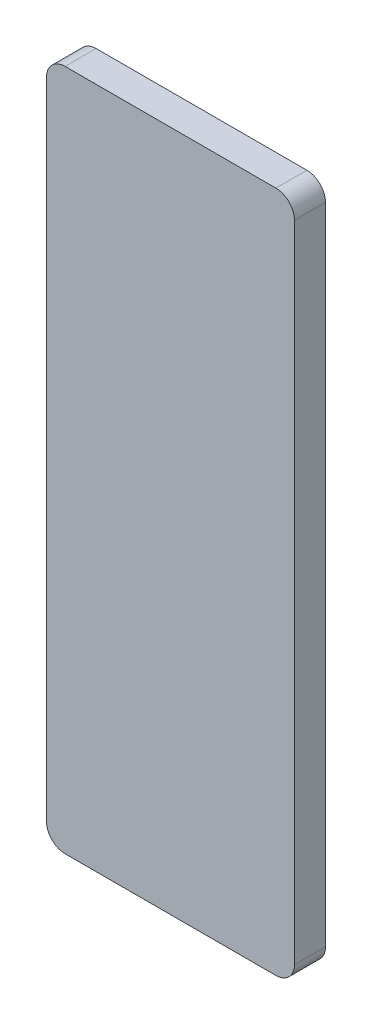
from build123d import *

# Parameters (mm, degrees)
SKETCH1_W           = 40
SKETCH1_H           = 110
BOSS_EXTRUDE1_DEPTH = 2.5
FILLET1_R           = 3


with BuildPart() as part:
    # Sketch1 → Boss-Extrude1 (new, symmetric)
    with BuildSketch(Plane.XY):
        Rectangle(SKETCH1_W, SKETCH1_H)
    extrude(amount=BOSS_EXTRUDE1_DEPTH, both=True)

    # Fillet1
    fillet1_edges = [part.edges().sort_by_distance(p)[0] for p in [
        (-20, 55, 0),
        (20, 55, 0),
        (20, -55, 0),
        (-20, -55, 0),
    ]]
    fillet(fillet1_edges, radius=FILLET1_R)


solid = part.part
